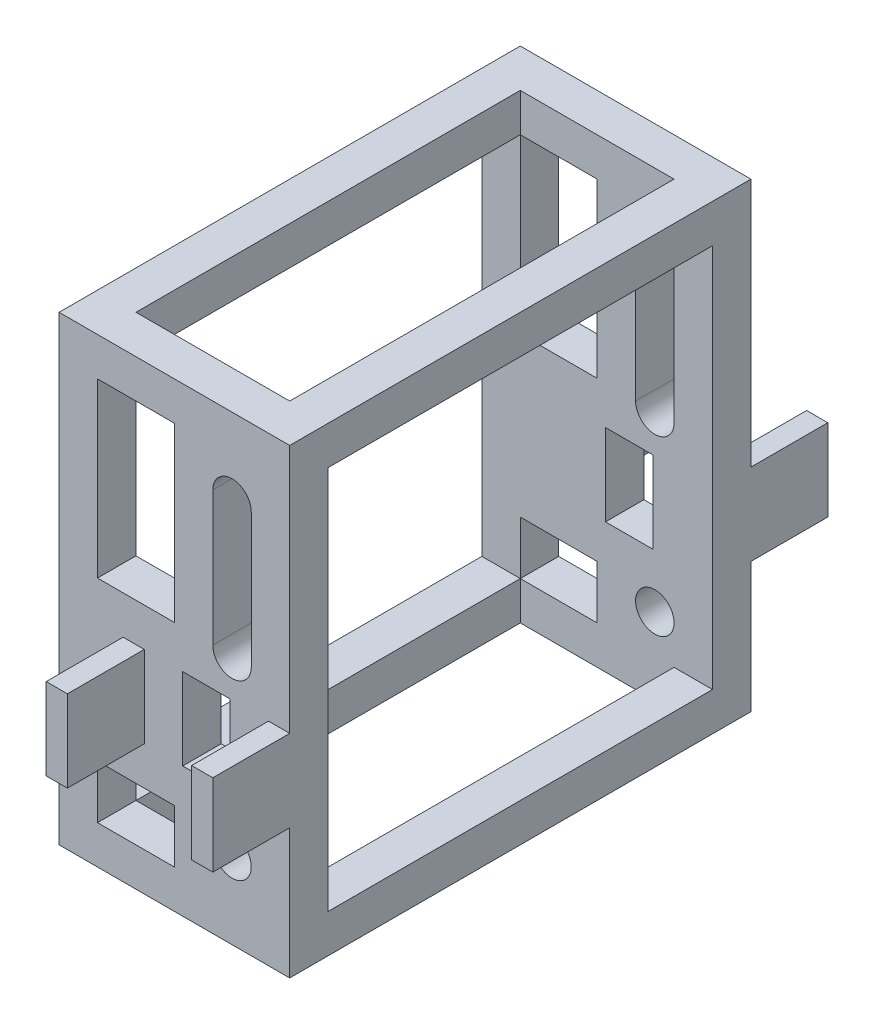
from build123d import *

# Parameters (mm, degrees)
SKETCH1_W           = 76.2
SKETCH1_H           = 152.4
BOSS_EXTRUDE1_DEPTH = 152.4
SKETCH2_W           = 50.8
SKETCH2_H           = 127
CUT_EXTRUDE1_DEPTH  = 229.6
SKETCH3_W           = 127
SKETCH3_H           = 127
CUT_EXTRUDE2_DEPTH  = 229.6
SKETCH4_W           = 7
SKETCH4_H           = 27
BOSS_EXTRUDE2_DEPTH = 25.4
SKETCH5_R           = 6.35
CUT_EXTRUDE3_DEPTH  = 247.262136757
SKETCH6_W           = 25.4
SKETCH6_H           = 57
SKETCH6_W_2         = 15.65
SKETCH6_H_2         = 27
SKETCH6_H_3         = 17.6
CUT_EXTRUDE4_DEPTH  = 247.262136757


with BuildPart() as part:
    # Sketch1 → Boss-Extrude1 (new body)
    with BuildSketch(Plane.XY):
        with Locations((38.1, 76.2)):
            Rectangle(SKETCH1_W, SKETCH1_H)
    extrude(amount=BOSS_EXTRUDE1_DEPTH)

    # Sketch2 → Cut-Extrude1 (cut, through all)
    with BuildSketch(Plane(origin=(0, 152.4, 0), x_dir=(1, 0, 0), z_dir=(0, 1, 0))):
        with Locations((38.1, -76.2)):
            Rectangle(SKETCH2_W, SKETCH2_H)
    extrude(amount=-CUT_EXTRUDE1_DEPTH, mode=Mode.SUBTRACT)

    # Sketch3 → Cut-Extrude2 (cut, through all)
    with BuildSketch(Plane(origin=(76.2, 0, 0), x_dir=(0, 0, -1), z_dir=(1, 0, 0))):
        with Locations((-76.2, 76.2)):
            Rectangle(SKETCH3_W, SKETCH3_H)
    extrude(amount=-CUT_EXTRUDE2_DEPTH, mode=Mode.SUBTRACT)

    # Sketch4 → Boss-Extrude2 (add)
    with BuildSketch(Plane.XY.offset(152.4)):
        with Locations((72.7, 56.5)):
            Rectangle(SKETCH4_W, SKETCH4_H)
        with Locations((24.65, 56.5)):
            Rectangle(SKETCH4_W, SKETCH4_H)
    boss_extrude2 = extrude(amount=BOSS_EXTRUDE2_DEPTH)

    # Mirror1: Boss-Extrude2 across plane
    add(boss_extrude2.mirror(Plane.XY.offset(76.2)))

    # Sketch5 → Cut-Extrude3 (cut, through all)
    with BuildSketch(Plane.XY.offset(152.4)):
        with Locations((57.15, 25.4)):
            Circle(SKETCH5_R)
        with BuildLine():
            Line((50.8, 127), (50.8, 82.55))
            ThreePointArc((50.8, 82.55), (57.15, 76.2), (63.5, 82.55))
            Line((63.5, 82.55), (63.5, 127))
            ThreePointArc((63.5, 127), (57.15, 133.35), (50.8, 127))
        make_face()
    extrude(amount=-CUT_EXTRUDE3_DEPTH, mode=Mode.SUBTRACT)

    # Sketch6 → Cut-Extrude4 (cut, through all)
    with BuildSketch(Plane.XY.offset(152.4)):
        with Locations((25.4, 111.2)):
            Rectangle(SKETCH6_W, SKETCH6_H)
        with Locations((48.675, 56.5)):
            Rectangle(SKETCH6_W_2, SKETCH6_H_2)
        with Locations((25.4, 21.5)):
            Rectangle(SKETCH6_W, SKETCH6_H_3)
    extrude(amount=-CUT_EXTRUDE4_DEPTH, mode=Mode.SUBTRACT)


solid = part.part
